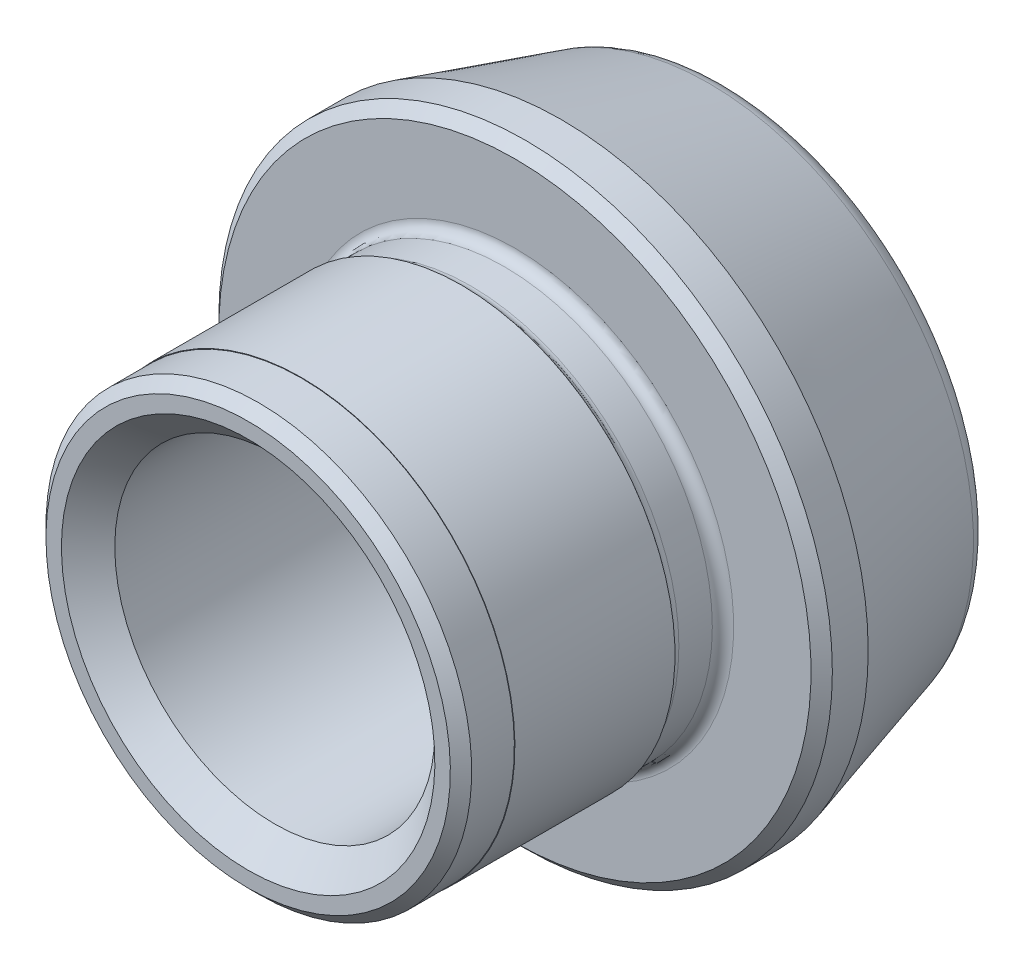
ISO-10303-21;
HEADER;
FILE_DESCRIPTION(('STEP AP214'),'2;1');
FILE_NAME('part.step','',(''),(''),'','','');
FILE_SCHEMA(('AUTOMOTIVE_DESIGN { 1 0 10303 214 1 1 1 1 }'));
ENDSEC;
DATA;
#1=APPLICATION_CONTEXT('core data for automotive mechanical design processes');
#2=APPLICATION_PROTOCOL_DEFINITION('international standard','automotive_design',2000,#1);
#3=PRODUCT_CONTEXT('',#1,'mechanical');
#4=PRODUCT('Part','Part','',(#3));
#5=PRODUCT_RELATED_PRODUCT_CATEGORY('part','',(#4));
#6=PRODUCT_DEFINITION_FORMATION('','',#4);
#7=PRODUCT_DEFINITION_CONTEXT('part definition',#1,'design');
#8=PRODUCT_DEFINITION('design','',#6,#7);
#9=PRODUCT_DEFINITION_SHAPE('','',#8);
#10=(LENGTH_UNIT() NAMED_UNIT(*) SI_UNIT(.MILLI.,.METRE.));
#11=(NAMED_UNIT(*) PLANE_ANGLE_UNIT() SI_UNIT($,.RADIAN.));
#12=(NAMED_UNIT(*) SI_UNIT($,.STERADIAN.) SOLID_ANGLE_UNIT());
#13=UNCERTAINTY_MEASURE_WITH_UNIT(LENGTH_MEASURE(1.E-05),#10,'distance_accuracy_value','');
#14=(GEOMETRIC_REPRESENTATION_CONTEXT(3) GLOBAL_UNCERTAINTY_ASSIGNED_CONTEXT((#13)) GLOBAL_UNIT_ASSIGNED_CONTEXT((#10,
#11,#12)) REPRESENTATION_CONTEXT('',''));
#15=CARTESIAN_POINT('',(0.,0.,0.));
#16=DIRECTION('',(0.,0.,1.));
#17=DIRECTION('',(1.,0.,0.));
#18=AXIS2_PLACEMENT_3D('',#15,#16,#17);
#19=CARTESIAN_POINT('',(0.,0.,0.));
#20=DIRECTION('',(0.,0.,-1.));
#21=DIRECTION('',(0.,1.,0.));
#22=AXIS2_PLACEMENT_3D('',#19,#20,#21);
#23=CYLINDRICAL_SURFACE('',#22,4.);
#24=CARTESIAN_POINT('',(0.,0.,4.));
#25=DIRECTION('',(0.,0.,-1.));
#26=DIRECTION('',(0.,1.,0.));
#27=AXIS2_PLACEMENT_3D('',#24,#25,#26);
#28=CIRCLE('',#27,4.);
#29=CARTESIAN_POINT('',(0.,4.,4.));
#30=VERTEX_POINT('',#29);
#31=EDGE_CURVE('E56',#30,#30,#28,.T.);
#32=ORIENTED_EDGE('',*,*,#31,.T.);
#33=EDGE_LOOP('',(#32));
#34=FACE_BOUND('',#33,.T.);
#35=CARTESIAN_POINT('',(0.,0.,1.));
#36=DIRECTION('',(0.,0.,-1.));
#37=DIRECTION('',(0.,1.,0.));
#38=AXIS2_PLACEMENT_3D('',#35,#36,#37);
#39=CIRCLE('',#38,4.);
#40=CARTESIAN_POINT('',(0.,4.,1.));
#41=VERTEX_POINT('',#40);
#42=EDGE_CURVE('E62',#41,#41,#39,.T.);
#43=ORIENTED_EDGE('',*,*,#42,.F.);
#44=EDGE_LOOP('',(#43));
#45=FACE_BOUND('',#44,.T.);
#46=ADVANCED_FACE('F12',(#34,#45),#23,.T.);
#47=CARTESIAN_POINT('',(2.5,0.,5.));
#48=DIRECTION('',(0.,0.,1.));
#49=DIRECTION('',(0.,-1.,0.));
#50=AXIS2_PLACEMENT_3D('',#47,#48,#49);
#51=PLANE('',#50);
#52=CARTESIAN_POINT('',(0.,0.,5.));
#53=DIRECTION('',(0.,0.,1.));
#54=DIRECTION('',(0.,-1.,0.));
#55=AXIS2_PLACEMENT_3D('',#52,#53,#54);
#56=CIRCLE('',#55,3.79);
#57=CARTESIAN_POINT('',(0.,-3.79,5.));
#58=VERTEX_POINT('',#57);
#59=EDGE_CURVE('E29',#58,#58,#56,.T.);
#60=ORIENTED_EDGE('',*,*,#59,.T.);
#61=EDGE_LOOP('',(#60));
#62=FACE_BOUND('',#61,.T.);
#63=CARTESIAN_POINT('',(0.,0.,5.));
#64=DIRECTION('',(0.,0.,1.));
#65=DIRECTION('',(0.,-1.,0.));
#66=AXIS2_PLACEMENT_3D('',#63,#64,#65);
#67=CIRCLE('',#66,3.5);
#68=CARTESIAN_POINT('',(0.,-3.5,5.));
#69=VERTEX_POINT('',#68);
#70=EDGE_CURVE('E35',#69,#69,#67,.F.);
#71=ORIENTED_EDGE('',*,*,#70,.T.);
#72=EDGE_LOOP('',(#71));
#73=FACE_BOUND('',#72,.T.);
#74=ADVANCED_FACE('F82',(#62,#73),#51,.T.);
#75=CARTESIAN_POINT('',(4.,0.,0.));
#76=DIRECTION('',(0.,0.,1.));
#77=DIRECTION('',(0.,-1.,0.));
#78=AXIS2_PLACEMENT_3D('',#75,#76,#77);
#79=PLANE('',#78);
#80=CARTESIAN_POINT('',(0.,0.,0.));
#81=DIRECTION('',(0.,0.,1.));
#82=DIRECTION('',(0.,-1.,0.));
#83=AXIS2_PLACEMENT_3D('',#80,#81,#82);
#84=CIRCLE('',#83,4.1);
#85=CARTESIAN_POINT('',(0.,-4.1,0.));
#86=VERTEX_POINT('',#85);
#87=EDGE_CURVE('E24',#86,#86,#84,.F.);
#88=ORIENTED_EDGE('',*,*,#87,.T.);
#89=EDGE_LOOP('',(#88));
#90=FACE_BOUND('',#89,.T.);
#91=CARTESIAN_POINT('',(0.,0.,0.));
#92=DIRECTION('',(0.,0.,1.));
#93=DIRECTION('',(0.,-1.,0.));
#94=AXIS2_PLACEMENT_3D('',#91,#92,#93);
#95=CIRCLE('',#94,5.55);
#96=CARTESIAN_POINT('',(0.,-5.55,0.));
#97=VERTEX_POINT('',#96);
#98=EDGE_CURVE('E41',#97,#97,#95,.T.);
#99=ORIENTED_EDGE('',*,*,#98,.T.);
#100=EDGE_LOOP('',(#99));
#101=FACE_BOUND('',#100,.T.);
#102=ADVANCED_FACE('F84',(#90,#101),#79,.T.);
#103=CARTESIAN_POINT('',(0.,0.,0.));
#104=DIRECTION('',(0.,0.,-1.));
#105=DIRECTION('',(0.,1.,0.));
#106=AXIS2_PLACEMENT_3D('',#103,#104,#105);
#107=CYLINDRICAL_SURFACE('',#106,5.75);
#108=CARTESIAN_POINT('',(0.,0.,-0.199999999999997));
#109=DIRECTION('',(0.,0.,1.));
#110=DIRECTION('',(0.,-1.,0.));
#111=AXIS2_PLACEMENT_3D('',#108,#109,#110);
#112=CIRCLE('',#111,5.75);
#113=CARTESIAN_POINT('',(0.,-5.75,-0.199999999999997));
#114=VERTEX_POINT('',#113);
#115=EDGE_CURVE('E44',#114,#114,#112,.F.);
#116=ORIENTED_EDGE('',*,*,#115,.T.);
#117=EDGE_LOOP('',(#116));
#118=FACE_BOUND('',#117,.T.);
#119=CARTESIAN_POINT('',(0.,0.,-0.871853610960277));
#120=DIRECTION('',(0.,0.,-1.));
#121=DIRECTION('',(0.,1.,0.));
#122=AXIS2_PLACEMENT_3D('',#119,#120,#121);
#123=CIRCLE('',#122,5.75);
#124=CARTESIAN_POINT('',(0.,5.75,-0.871853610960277));
#125=VERTEX_POINT('',#124);
#126=EDGE_CURVE('E53',#125,#125,#123,.T.);
#127=ORIENTED_EDGE('',*,*,#126,.F.);
#128=EDGE_LOOP('',(#127));
#129=FACE_BOUND('',#128,.T.);
#130=ADVANCED_FACE('F92',(#118,#129),#107,.T.);
#131=CARTESIAN_POINT('',(0.,0.,-4.));
#132=DIRECTION('',(0.,0.,1.));
#133=DIRECTION('',(0.,-1.,0.));
#134=AXIS2_PLACEMENT_3D('',#131,#132,#133);
#135=CONICAL_SURFACE('',#134,4.85301845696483,0.279252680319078);
#136=CARTESIAN_POINT('',(0.,0.,-3.63781867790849));
#137=DIRECTION('',(0.,0.,-1.));
#138=DIRECTION('',(0.,1.,0.));
#139=AXIS2_PLACEMENT_3D('',#136,#137,#138);
#140=CIRCLE('',#139,4.95687227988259);
#141=CARTESIAN_POINT('',(0.,4.95687227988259,-3.63781867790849));
#142=VERTEX_POINT('',#141);
#143=EDGE_CURVE('E47',#142,#142,#140,.F.);
#144=ORIENTED_EDGE('',*,*,#143,.T.);
#145=EDGE_LOOP('',(#144));
#146=FACE_BOUND('',#145,.T.);
#147=ORIENTED_EDGE('',*,*,#126,.T.);
#148=EDGE_LOOP('',(#147));
#149=FACE_BOUND('',#148,.T.);
#150=ADVANCED_FACE('F104',(#146,#149),#135,.T.);
#151=CARTESIAN_POINT('',(2.5,0.,-4.));
#152=DIRECTION('',(0.,0.,-1.));
#153=DIRECTION('',(0.,1.,0.));
#154=AXIS2_PLACEMENT_3D('',#151,#152,#153);
#155=PLANE('',#154);
#156=CARTESIAN_POINT('',(0.,0.,-4.));
#157=DIRECTION('',(0.,0.,-1.));
#158=DIRECTION('',(0.,1.,0.));
#159=AXIS2_PLACEMENT_3D('',#156,#157,#158);
#160=CIRCLE('',#159,3.5);
#161=CARTESIAN_POINT('',(0.,3.5,-4.));
#162=VERTEX_POINT('',#161);
#163=EDGE_CURVE('E38',#162,#162,#160,.F.);
#164=ORIENTED_EDGE('',*,*,#163,.T.);
#165=EDGE_LOOP('',(#164));
#166=FACE_BOUND('',#165,.T.);
#167=CARTESIAN_POINT('',(0.,0.,-4.));
#168=DIRECTION('',(0.,0.,-1.));
#169=DIRECTION('',(0.,1.,0.));
#170=AXIS2_PLACEMENT_3D('',#167,#168,#169);
#171=CIRCLE('',#170,4.47624143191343);
#172=CARTESIAN_POINT('',(0.,4.47624143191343,-4.));
#173=VERTEX_POINT('',#172);
#174=EDGE_CURVE('E50',#173,#173,#171,.T.);
#175=ORIENTED_EDGE('',*,*,#174,.T.);
#176=EDGE_LOOP('',(#175));
#177=FACE_BOUND('',#176,.T.);
#178=ADVANCED_FACE('F100',(#166,#177),#155,.T.);
#179=CARTESIAN_POINT('',(0.,0.,-3.5));
#180=DIRECTION('',(0.,0.,-1.));
#181=DIRECTION('',(0.,1.,0.));
#182=AXIS2_PLACEMENT_3D('',#179,#180,#181);
#183=TOROIDAL_SURFACE('',#182,4.47624143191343,0.5);
#184=ORIENTED_EDGE('',*,*,#143,.F.);
#185=EDGE_LOOP('',(#184));
#186=FACE_BOUND('',#185,.T.);
#187=ORIENTED_EDGE('',*,*,#174,.F.);
#188=EDGE_LOOP('',(#187));
#189=FACE_BOUND('',#188,.T.);
#190=ADVANCED_FACE('F103',(#186,#189),#183,.T.);
#191=CARTESIAN_POINT('',(0.,0.,-0.199999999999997));
#192=DIRECTION('',(0.,0.,-1.));
#193=DIRECTION('',(0.,1.,0.));
#194=AXIS2_PLACEMENT_3D('',#191,#192,#193);
#195=CONICAL_SURFACE('',#194,5.75,0.785398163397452);
#196=ORIENTED_EDGE('',*,*,#98,.F.);
#197=EDGE_LOOP('',(#196));
#198=FACE_BOUND('',#197,.T.);
#199=ORIENTED_EDGE('',*,*,#115,.F.);
#200=EDGE_LOOP('',(#199));
#201=FACE_BOUND('',#200,.T.);
#202=ADVANCED_FACE('F114',(#198,#201),#195,.T.);
#203=CARTESIAN_POINT('',(0.,0.,-3.));
#204=DIRECTION('',(0.,0.,-1.));
#205=DIRECTION('',(0.,1.,0.));
#206=AXIS2_PLACEMENT_3D('',#203,#204,#205);
#207=CONICAL_SURFACE('',#206,2.5,0.78539816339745);
#208=CARTESIAN_POINT('',(0.,0.,-3.5));
#209=DIRECTION('',(0.,0.,-1.));
#210=DIRECTION('',(0.,1.,0.));
#211=AXIS2_PLACEMENT_3D('',#208,#209,#210);
#212=CIRCLE('',#211,3.);
#213=CARTESIAN_POINT('',(0.,3.,-3.5));
#214=VERTEX_POINT('',#213);
#215=EDGE_CURVE('E65',#214,#214,#212,.T.);
#216=ORIENTED_EDGE('',*,*,#215,.F.);
#217=EDGE_LOOP('',(#216));
#218=FACE_BOUND('',#217,.T.);
#219=ORIENTED_EDGE('',*,*,#163,.F.);
#220=EDGE_LOOP('',(#219));
#221=FACE_BOUND('',#220,.T.);
#222=ADVANCED_FACE('F78',(#218,#221),#207,.F.);
#223=CARTESIAN_POINT('',(0.,0.,5.));
#224=DIRECTION('',(0.,0.,1.));
#225=DIRECTION('',(0.,-1.,0.));
#226=AXIS2_PLACEMENT_3D('',#223,#224,#225);
#227=CONICAL_SURFACE('',#226,3.5,0.785398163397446);
#228=CARTESIAN_POINT('',(0.,0.,4.5));
#229=DIRECTION('',(0.,0.,1.));
#230=DIRECTION('',(0.,-1.,0.));
#231=AXIS2_PLACEMENT_3D('',#228,#229,#230);
#232=CIRCLE('',#231,3.);
#233=CARTESIAN_POINT('',(0.,-3.,4.5));
#234=VERTEX_POINT('',#233);
#235=EDGE_CURVE('E16',#234,#234,#232,.T.);
#236=ORIENTED_EDGE('',*,*,#235,.F.);
#237=EDGE_LOOP('',(#236));
#238=FACE_BOUND('',#237,.T.);
#239=ORIENTED_EDGE('',*,*,#70,.F.);
#240=EDGE_LOOP('',(#239));
#241=FACE_BOUND('',#240,.T.);
#242=ADVANCED_FACE('F74',(#238,#241),#227,.F.);
#243=CARTESIAN_POINT('',(-4.,0.,4.));
#244=DIRECTION('',(0.,0.,1.));
#245=DIRECTION('',(0.,-1.,0.));
#246=AXIS2_PLACEMENT_3D('',#243,#244,#245);
#247=PLANE('',#246);
#248=CARTESIAN_POINT('',(0.,0.,4.));
#249=DIRECTION('',(0.,0.,-1.));
#250=DIRECTION('',(0.,1.,0.));
#251=AXIS2_PLACEMENT_3D('',#248,#249,#250);
#252=CIRCLE('',#251,3.99);
#253=CARTESIAN_POINT('',(0.,3.99,4.));
#254=VERTEX_POINT('',#253);
#255=EDGE_CURVE('E59',#254,#254,#252,.T.);
#256=ORIENTED_EDGE('',*,*,#255,.T.);
#257=EDGE_LOOP('',(#256));
#258=FACE_BOUND('',#257,.T.);
#259=ORIENTED_EDGE('',*,*,#31,.F.);
#260=EDGE_LOOP('',(#259));
#261=FACE_BOUND('',#260,.T.);
#262=ADVANCED_FACE('F77',(#258,#261),#247,.T.);
#263=CARTESIAN_POINT('',(0.,0.,0.));
#264=DIRECTION('',(0.,0.,-1.));
#265=DIRECTION('',(0.,1.,0.));
#266=AXIS2_PLACEMENT_3D('',#263,#264,#265);
#267=CYLINDRICAL_SURFACE('',#266,3.99);
#268=CARTESIAN_POINT('',(0.,0.,4.8));
#269=DIRECTION('',(0.,0.,1.));
#270=DIRECTION('',(0.,-1.,0.));
#271=AXIS2_PLACEMENT_3D('',#268,#269,#270);
#272=CIRCLE('',#271,3.99);
#273=CARTESIAN_POINT('',(0.,-3.99,4.8));
#274=VERTEX_POINT('',#273);
#275=EDGE_CURVE('E32',#274,#274,#272,.F.);
#276=ORIENTED_EDGE('',*,*,#275,.T.);
#277=EDGE_LOOP('',(#276));
#278=FACE_BOUND('',#277,.T.);
#279=ORIENTED_EDGE('',*,*,#255,.F.);
#280=EDGE_LOOP('',(#279));
#281=FACE_BOUND('',#280,.T.);
#282=ADVANCED_FACE('F125',(#278,#281),#267,.T.);
#283=CARTESIAN_POINT('',(0.,0.,4.8));
#284=DIRECTION('',(0.,0.,-1.));
#285=DIRECTION('',(0.,1.,0.));
#286=AXIS2_PLACEMENT_3D('',#283,#284,#285);
#287=CONICAL_SURFACE('',#286,3.99,0.785398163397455);
#288=ORIENTED_EDGE('',*,*,#59,.F.);
#289=EDGE_LOOP('',(#288));
#290=FACE_BOUND('',#289,.T.);
#291=ORIENTED_EDGE('',*,*,#275,.F.);
#292=EDGE_LOOP('',(#291));
#293=FACE_BOUND('',#292,.T.);
#294=ADVANCED_FACE('F122',(#290,#293),#287,.T.);
#295=CARTESIAN_POINT('',(0.,0.,0.));
#296=DIRECTION('',(0.,0.,-1.));
#297=DIRECTION('',(0.,1.,0.));
#298=AXIS2_PLACEMENT_3D('',#295,#296,#297);
#299=CYLINDRICAL_SURFACE('',#298,3.9);
#300=CARTESIAN_POINT('',(0.,0.,0.2));
#301=DIRECTION('',(0.,0.,1.));
#302=DIRECTION('',(0.,-1.,0.));
#303=AXIS2_PLACEMENT_3D('',#300,#301,#302);
#304=CIRCLE('',#303,3.9);
#305=CARTESIAN_POINT('',(0.,-3.9,0.2));
#306=VERTEX_POINT('',#305);
#307=EDGE_CURVE('E8',#306,#306,#304,.T.);
#308=ORIENTED_EDGE('',*,*,#307,.T.);
#309=EDGE_LOOP('',(#308));
#310=FACE_BOUND('',#309,.T.);
#311=CARTESIAN_POINT('',(0.,0.,0.826794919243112));
#312=DIRECTION('',(0.,0.,1.));
#313=DIRECTION('',(0.,-1.,0.));
#314=AXIS2_PLACEMENT_3D('',#311,#312,#313);
#315=CIRCLE('',#314,3.9);
#316=CARTESIAN_POINT('',(0.,-3.9,0.826794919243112));
#317=VERTEX_POINT('',#316);
#318=EDGE_CURVE('E20',#317,#317,#315,.F.);
#319=ORIENTED_EDGE('',*,*,#318,.T.);
#320=EDGE_LOOP('',(#319));
#321=FACE_BOUND('',#320,.T.);
#322=ADVANCED_FACE('F124',(#310,#321),#299,.T.);
#323=CARTESIAN_POINT('',(0.,0.,0.2));
#324=DIRECTION('',(0.,0.,1.));
#325=DIRECTION('',(0.,-1.,0.));
#326=AXIS2_PLACEMENT_3D('',#323,#324,#325);
#327=TOROIDAL_SURFACE('',#326,4.1,0.2);
#328=ORIENTED_EDGE('',*,*,#307,.F.);
#329=EDGE_LOOP('',(#328));
#330=FACE_BOUND('',#329,.T.);
#331=ORIENTED_EDGE('',*,*,#87,.F.);
#332=EDGE_LOOP('',(#331));
#333=FACE_BOUND('',#332,.T.);
#334=ADVANCED_FACE('F127',(#330,#333),#327,.F.);
#335=CARTESIAN_POINT('',(0.,0.,0.826794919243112));
#336=DIRECTION('',(0.,0.,1.));
#337=DIRECTION('',(0.,-1.,0.));
#338=AXIS2_PLACEMENT_3D('',#335,#336,#337);
#339=TOROIDAL_SURFACE('',#338,4.1,0.2);
#340=ORIENTED_EDGE('',*,*,#42,.T.);
#341=EDGE_LOOP('',(#340));
#342=FACE_BOUND('',#341,.T.);
#343=ORIENTED_EDGE('',*,*,#318,.F.);
#344=EDGE_LOOP('',(#343));
#345=FACE_BOUND('',#344,.T.);
#346=ADVANCED_FACE('F14',(#342,#345),#339,.F.);
#347=CARTESIAN_POINT('',(0.,0.,-4.));
#348=DIRECTION('',(0.,0.,1.));
#349=DIRECTION('',(0.,-1.,0.));
#350=AXIS2_PLACEMENT_3D('',#347,#348,#349);
#351=CYLINDRICAL_SURFACE('',#350,3.);
#352=ORIENTED_EDGE('',*,*,#215,.T.);
#353=EDGE_LOOP('',(#352));
#354=FACE_BOUND('',#353,.T.);
#355=ORIENTED_EDGE('',*,*,#235,.T.);
#356=EDGE_LOOP('',(#355));
#357=FACE_BOUND('',#356,.T.);
#358=ADVANCED_FACE('F72',(#354,#357),#351,.F.);
#359=CLOSED_SHELL('',(#46,#74,#102,#130,#150,#178,#190,#202,#222,#242,#262,#282,#294,#322,#334,
#346,#358));
#360=MANIFOLD_SOLID_BREP('B1',#359);
#361=ADVANCED_BREP_SHAPE_REPRESENTATION('',(#18,#360),#14);
#362=SHAPE_DEFINITION_REPRESENTATION(#9,#361);
ENDSEC;
END-ISO-10303-21;
